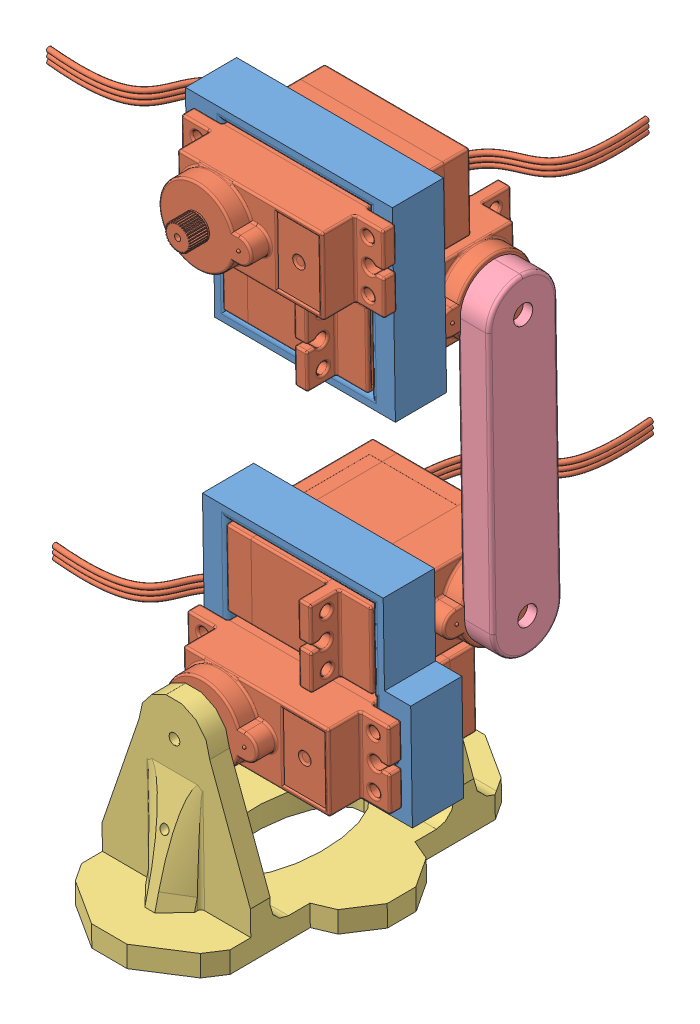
SolidWorks assembly Micro FOBO2.SLDASM, configuration Default (file format 10000). Lengths in mm.
Overall size (60.02 101.26 76.79).
8 component instances, 4 part files, 22 mates.
Components (placement in the parent):
- Part 2 Servo Band V3-1: Part 2 Servo Band V3.SLDPRT [Default] at (-36.5809 -3.0143 -106.0723) x (0.999969 0.003242 0.007124) z (0.003333 -0.999913 -0.012798) size (32.81 8 29.4)
- Servo HXT900 Micro-1: Servo HXT900 Micro.SLDPRT [Valor predeterminado] at (-21.2414 5.1272 -113.8601) x (0.999969 0.003242 0.007124) z (0.003333 -0.999913 -0.012798) size (56.55 29.01 12.2)
- Servo HXT900 Micro-2: Servo HXT900 Micro.SLDPRT [Valor predeterminado] at (-32.6301 18.4473 -108.9263) x (-0.007082 -0.012822 0.999893) z (-0.003333 0.999913 0.012798) size (56.55 29.01 12.2)
- Part 1 Foot-3: Part 1 Foot.SLDPRT [Default] at (-26.3798 -24.0567 -151.3485) x (-0.999969 -0.003242 -0.007124) z (-0.003333 0.999913 0.012798) size (35.92 56 30.24)
- Part 3 Servo Bracket-2: Part 3 Servo Bracket.SLDPRT [Default] at (-2.1609 39.2447 -113.9294) x (0.003333 -0.999913 -0.012798) z (0.007082 0.012822 -0.999893) size (52 5 10.77)
- Part 2 Servo Band V3-2: Part 2 Servo Band V3.SLDPRT [Default] at (-5.8621 81.1489 -104.7755) x (-0.999969 -0.003242 -0.007124) z (-0.003333 0.999913 0.012798) size (32.81 8 29.4)
- Servo HXT900 Micro-3: Servo HXT900 Micro.SLDPRT [Valor predeterminado] at (-32.7676 59.7037 -108.3983) x (-0.007082 -0.012822 0.999893) z (-0.003333 0.999913 0.012798) size (56.55 29.01 12.2)
- Servo HXT900 Micro-4: Servo HXT900 Micro.SLDPRT [Valor predeterminado] at (-21.2783 73.2019 -112.9875) x (0.999969 0.003242 0.007124) z (0.003333 -0.999913 -0.012798) size (56.55 29.01 12.2)
Mates (geometry in assembly coordinates):
- Coincident1: coincident anti-aligned: plane of Part 2 Servo Band V3-1 through (-36.6376 -3.1169 -98.0732) normal (-0.007082 -0.012822 0.999893); plane of Servo HXT900 Micro-1 through (-21.3547 4.9221 -97.8618) normal (0.007082 0.012822 -0.999893)
- Coincident4: coincident anti-aligned: plane of Part 2 Servo Band V3-1 through (-9.8509 3.7086 -97.7959) normal (-0.999969 -0.003242 -0.007124); plane of Servo HXT900 Micro-1 through (-9.8846 -1.1299 -90.8575) normal (0.999969 0.003242 0.007124)
- Coincident5: coincident anti-aligned: plane of Part 2 Servo Band V3-1 through (-32.6444 -1.1041 -98.0191) normal (-0.003333 0.999913 0.012798); plane of Servo HXT900 Micro-1 through (-21.2214 -0.8623 -113.9368) normal (0.003333 -0.999913 -0.012798)
- Coincident6: coincident anti-aligned: plane of Part 2 Servo Band V3-1 through (-32.729 24.2937 -97.694) normal (0.999969 0.003242 0.007124); plane of Servo HXT900 Micro-2 through (-32.6301 18.4473 -108.9263) normal (-0.999969 -0.003242 -0.007124)
- Coincident7: coincident anti-aligned: plane of Part 2 Servo Band V3-1 through (-10.0797 24.3671 -97.5326) normal (0.003333 -0.999913 -0.012798); plane of Servo HXT900 Micro-2 through (-32.65 24.4368 -108.8497) normal (-0.003333 0.999913 0.012798)
- Tangent1: tangent anti-aligned: plane of Part 2 Servo Band V3-1 through (-36.5809 -3.0143 -106.0723) normal (0.007082 0.012822 -0.999893); cylinder of Servo HXT900 Micro-2 through (-6.639 18.5167 -107.5844) axis (-0.999969 -0.003242 -0.007124) radius 2
- Parallel2: parallel anti-aligned: plane of Servo HXT900 Micro-1 through (-21.2414 5.1272 -113.8601) normal (0.007082 0.012822 -0.999893); plane of Part 1 Foot-3 through (-14.9872 10.7653 -115.1685) normal (-0.007082 -0.012822 0.999893)
- Coincident11: coincident anti-aligned: plane of Servo HXT900 Micro-1 through (-26.9466 4.7376 -84.9024) normal (-0.007082 -0.012822 0.999893); plane of Part 1 Foot-3 through (-26.9466 4.7376 -84.9024) normal (0.007082 0.012822 -0.999893)
- Concentric5: concentric aligned: cylinder of Servo HXT900 Micro-1 through (-26.9253 4.776 -87.9021) axis (0.007082 0.012822 -0.999893) radius 6; cylinder of Part 1 Foot-3 through (-27.0312 4.5844 -72.9561) axis (0.007082 0.012822 -0.999893) radius 5.6
- Coincident14: coincident anti-aligned: plane of Servo HXT900 Micro-2 through (-3.592 18.6118 -114.2191) normal (0.999969 0.003242 0.007124); plane of Part 3 Servo Bracket-2 through (-3.6609 39.2398 -113.9401) normal (-0.999969 -0.003242 -0.007124)
- Concentric7: concentric aligned: cylinder of Servo HXT900 Micro-2 through (-6.5919 18.6021 -114.2405) axis (-0.999969 -0.003242 -0.007124) radius 6; cylinder of Part 3 Servo Bracket-2 through (-3.592 18.6118 -114.2191) axis (-0.999969 -0.003242 -0.007124) radius 3.65
- Parallel8: parallel aligned: plane of Servo HXT900 Micro-2 through (-9.5693 24.6688 -120.1844) normal (0.007082 0.012822 -0.999893); plane of Part 3 Servo Bracket-2 through (-7.2093 65.2952 -119.0167) normal (0.007082 0.012822 -0.999893)
- Parallel9: parallel aligned: plane of Part 2 Servo Band V3-1 through (-3.8843 13.6881 -97.6257) normal (0.999969 0.003242 0.007124); plane of Part 1 Foot-3 through (-15.1462 -16.5623 -80.4239) normal (0.999969 0.003242 0.007124)
- Coincident17: coincident anti-aligned: plane of Part 2 Servo Band V3-2 through (-5.9187 81.0463 -96.7764) normal (-0.007082 -0.012822 0.999893); plane of Servo HXT900 Micro-4 through (-21.3916 72.9967 -96.9892) normal (0.007082 0.012822 -0.999893)
- Coincident18: coincident anti-aligned: plane of Part 2 Servo Band V3-2 through (-9.912 79.0335 -96.8305) normal (0.003333 -0.999913 -0.012798); plane of Servo HXT900 Micro-4 through (-9.9615 78.9437 -89.8312) normal (-0.003333 0.999913 0.012798)
- Coincident19: coincident anti-aligned: plane of Part 2 Servo Band V3-2 through (-9.8273 53.6357 -97.1556) normal (-0.999969 -0.003242 -0.007124); plane of Servo HXT900 Micro-4 through (-9.9215 66.9448 -89.9848) normal (0.999969 0.003242 0.007124)
- Coincident20: coincident anti-aligned: plane of Part 2 Servo Band V3-2 through (-9.8273 53.6357 -97.1556) normal (-0.999969 -0.003242 -0.007124); plane of Servo HXT900 Micro-3 through (-9.7683 59.7782 -108.2344) normal (0.999969 0.003242 0.007124)
- Coincident22: coincident anti-aligned: plane of Part 2 Servo Band V3-2 through (-32.4766 53.5623 -97.3169) normal (-0.003333 0.999913 0.012798); plane of Servo HXT900 Micro-3 through (-9.8297 53.6313 -96.8124) normal (0.003333 -0.999913 -0.012798)
- Tangent4: tangent anti-aligned: plane of Part 2 Servo Band V3-2 through (-5.8621 81.1489 -104.7755) normal (0.007082 0.012822 -0.999893); cylinder of Servo HXT900 Micro-3 through (-6.7766 59.7731 -107.0563) axis (-0.999969 -0.003242 -0.007124) radius 2
- Coincident23: coincident anti-aligned: plane of Part 3 Servo Bracket-2 through (-3.6609 39.2398 -113.9401) normal (-0.999969 -0.003242 -0.007124); plane of Servo HXT900 Micro-3 through (-3.7295 59.8682 -113.6911) normal (0.999969 0.003242 0.007124)
- Concentric8: concentric aligned: cylinder of Part 3 Servo Bracket-2 through (-3.7295 59.8682 -113.6911) axis (-0.999969 -0.003242 -0.007124) radius 3.65; cylinder of Servo HXT900 Micro-3 through (-6.7294 59.8585 -113.7125) axis (-0.999969 -0.003242 -0.007124) radius 6
- Parallel10: parallel anti-aligned: plane of Part 3 Servo Bracket-2 through (-7.2855 65.1572 -108.2479) normal (-0.007082 -0.012822 0.999893); plane of Part 2 Servo Band V3-2 through (-5.8621 81.1489 -104.7755) normal (0.007082 0.012822 -0.999893)
